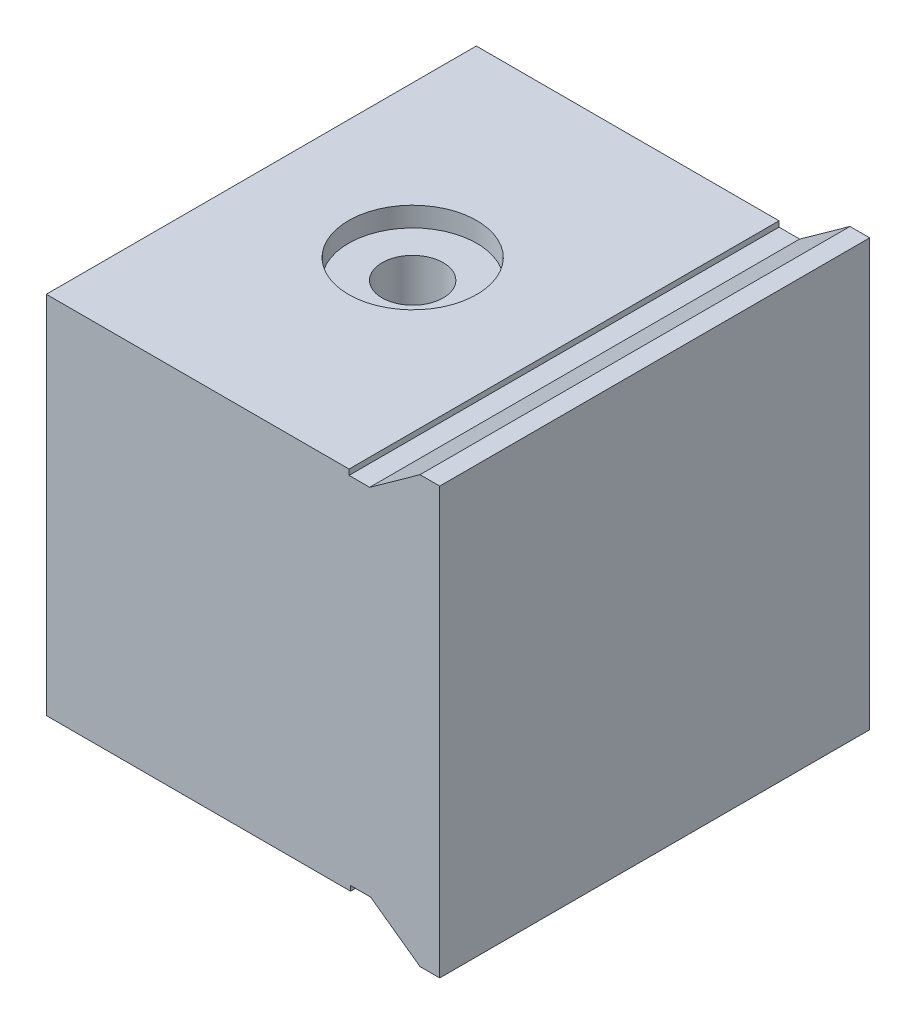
ISO-10303-21;
HEADER;
FILE_DESCRIPTION(('STEP AP214'),'2;1');
FILE_NAME('part.step','',(''),(''),'','','');
FILE_SCHEMA(('AUTOMOTIVE_DESIGN { 1 0 10303 214 1 1 1 1 }'));
ENDSEC;
DATA;
#1=APPLICATION_CONTEXT('core data for automotive mechanical design processes');
#2=APPLICATION_PROTOCOL_DEFINITION('international standard','automotive_design',2000,#1);
#3=PRODUCT_CONTEXT('',#1,'mechanical');
#4=PRODUCT('Part','Part','',(#3));
#5=PRODUCT_RELATED_PRODUCT_CATEGORY('part','',(#4));
#6=PRODUCT_DEFINITION_FORMATION('','',#4);
#7=PRODUCT_DEFINITION_CONTEXT('part definition',#1,'design');
#8=PRODUCT_DEFINITION('design','',#6,#7);
#9=PRODUCT_DEFINITION_SHAPE('','',#8);
#10=(LENGTH_UNIT() NAMED_UNIT(*) SI_UNIT(.MILLI.,.METRE.));
#11=(NAMED_UNIT(*) PLANE_ANGLE_UNIT() SI_UNIT($,.RADIAN.));
#12=(NAMED_UNIT(*) SI_UNIT($,.STERADIAN.) SOLID_ANGLE_UNIT());
#13=UNCERTAINTY_MEASURE_WITH_UNIT(LENGTH_MEASURE(1.E-05),#10,'distance_accuracy_value','');
#14=(GEOMETRIC_REPRESENTATION_CONTEXT(3) GLOBAL_UNCERTAINTY_ASSIGNED_CONTEXT((#13)) GLOBAL_UNIT_ASSIGNED_CONTEXT((#10,
#11,#12)) REPRESENTATION_CONTEXT('',''));
#15=CARTESIAN_POINT('',(0.,0.,0.));
#16=DIRECTION('',(0.,0.,1.));
#17=DIRECTION('',(1.,0.,0.));
#18=AXIS2_PLACEMENT_3D('',#15,#16,#17);
#19=CARTESIAN_POINT('',(-1.16941230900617E-13,-16.7583056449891,-21.8));
#20=DIRECTION('',(0.,1.,0.));
#21=DIRECTION('',(-1.,0.,0.));
#22=AXIS2_PLACEMENT_3D('',#19,#20,#21);
#23=PLANE('',#22);
#24=DIRECTION('',(0.,0.,1.));
#25=VECTOR('',#24,1.);
#26=CARTESIAN_POINT('',(-0.135433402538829,-16.758305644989,-21.8));
#27=LINE('',#26,#25);
#28=CARTESIAN_POINT('',(-0.135433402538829,-16.758305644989,-21.8));
#29=VERTEX_POINT('',#28);
#30=CARTESIAN_POINT('',(-0.135433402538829,-16.758305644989,21.8));
#31=VERTEX_POINT('',#30);
#32=EDGE_CURVE('E303',#29,#31,#27,.T.);
#33=ORIENTED_EDGE('',*,*,#32,.T.);
#34=DIRECTION('',(-1.,0.,0.));
#35=VECTOR('',#34,1.);
#36=CARTESIAN_POINT('',(-1.16941230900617E-13,-16.7583056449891,21.8));
#37=LINE('',#36,#35);
#38=CARTESIAN_POINT('',(-30.989332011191,-16.7583056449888,21.8));
#39=VERTEX_POINT('',#38);
#40=EDGE_CURVE('E223',#31,#39,#37,.T.);
#41=ORIENTED_EDGE('',*,*,#40,.T.);
#42=DIRECTION('',(0.,0.,1.));
#43=VECTOR('',#42,1.);
#44=CARTESIAN_POINT('',(-30.989332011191,-16.7583056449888,-21.8));
#45=LINE('',#44,#43);
#46=CARTESIAN_POINT('',(-30.989332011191,-16.7583056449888,-21.8));
#47=VERTEX_POINT('',#46);
#48=EDGE_CURVE('E11',#47,#39,#45,.T.);
#49=ORIENTED_EDGE('',*,*,#48,.F.);
#50=DIRECTION('',(-1.,0.,0.));
#51=VECTOR('',#50,1.);
#52=CARTESIAN_POINT('',(-1.16941230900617E-13,-16.7583056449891,-21.8));
#53=LINE('',#52,#51);
#54=EDGE_CURVE('E72',#29,#47,#53,.T.);
#55=ORIENTED_EDGE('',*,*,#54,.F.);
#56=EDGE_LOOP('',(#33,#41,#49,#55));
#57=FACE_BOUND('',#56,.T.);
#58=ADVANCED_FACE('F47',(#57),#23,.F.);
#59=CARTESIAN_POINT('',(-30.989332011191,0.,-21.8));
#60=DIRECTION('',(-1.,0.,0.));
#61=DIRECTION('',(0.,0.,1.));
#62=AXIS2_PLACEMENT_3D('',#59,#60,#61);
#63=PLANE('',#62);
#64=DIRECTION('',(0.,1.,0.));
#65=VECTOR('',#64,1.);
#66=CARTESIAN_POINT('',(-30.989332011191,-8.75830564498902,10.5));
#67=LINE('',#66,#65);
#68=CARTESIAN_POINT('',(-30.989332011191,-8.75830564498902,10.5));
#69=VERTEX_POINT('',#68);
#70=CARTESIAN_POINT('',(-30.989332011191,12.241694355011,10.5));
#71=VERTEX_POINT('',#70);
#72=EDGE_CURVE('E64',#69,#71,#67,.T.);
#73=ORIENTED_EDGE('',*,*,#72,.F.);
#74=DIRECTION('',(0.,0.,1.));
#75=VECTOR('',#74,1.);
#76=CARTESIAN_POINT('',(-30.989332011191,-8.75830564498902,-10.5));
#77=LINE('',#76,#75);
#78=CARTESIAN_POINT('',(-30.989332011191,-8.75830564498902,-10.5));
#79=VERTEX_POINT('',#78);
#80=EDGE_CURVE('E187',#79,#69,#77,.T.);
#81=ORIENTED_EDGE('',*,*,#80,.F.);
#82=DIRECTION('',(0.,-1.,0.));
#83=VECTOR('',#82,1.);
#84=CARTESIAN_POINT('',(-30.989332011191,-8.75830564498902,-10.5));
#85=LINE('',#84,#83);
#86=CARTESIAN_POINT('',(-30.989332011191,12.241694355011,-10.5));
#87=VERTEX_POINT('',#86);
#88=EDGE_CURVE('E191',#87,#79,#85,.T.);
#89=ORIENTED_EDGE('',*,*,#88,.F.);
#90=DIRECTION('',(0.,0.,-1.));
#91=VECTOR('',#90,1.);
#92=CARTESIAN_POINT('',(-30.989332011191,12.241694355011,-10.5));
#93=LINE('',#92,#91);
#94=EDGE_CURVE('E200',#71,#87,#93,.T.);
#95=ORIENTED_EDGE('',*,*,#94,.F.);
#96=EDGE_LOOP('',(#73,#81,#89,#95));
#97=FACE_BOUND('',#96,.T.);
#98=ORIENTED_EDGE('',*,*,#48,.T.);
#99=DIRECTION('',(0.,-1.,0.));
#100=VECTOR('',#99,1.);
#101=CARTESIAN_POINT('',(-30.989332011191,0.,21.8));
#102=LINE('',#101,#100);
#103=CARTESIAN_POINT('',(-30.989332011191,20.241694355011,21.8));
#104=VERTEX_POINT('',#103);
#105=EDGE_CURVE('E264',#104,#39,#102,.T.);
#106=ORIENTED_EDGE('',*,*,#105,.F.);
#107=DIRECTION('',(0.,0.,1.));
#108=VECTOR('',#107,1.);
#109=CARTESIAN_POINT('',(-30.989332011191,20.241694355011,-21.8));
#110=LINE('',#109,#108);
#111=CARTESIAN_POINT('',(-30.989332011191,20.241694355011,-21.8));
#112=VERTEX_POINT('',#111);
#113=EDGE_CURVE('E56',#112,#104,#110,.T.);
#114=ORIENTED_EDGE('',*,*,#113,.F.);
#115=DIRECTION('',(0.,-1.,0.));
#116=VECTOR('',#115,1.);
#117=CARTESIAN_POINT('',(-30.989332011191,0.,-21.8));
#118=LINE('',#117,#116);
#119=EDGE_CURVE('E300',#112,#47,#118,.T.);
#120=ORIENTED_EDGE('',*,*,#119,.T.);
#121=EDGE_LOOP('',(#98,#106,#114,#120));
#122=FACE_BOUND('',#121,.T.);
#123=ADVANCED_FACE('F356',(#97,#122),#63,.T.);
#124=CARTESIAN_POINT('',(0.,20.241694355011,-21.8));
#125=DIRECTION('',(0.,1.,0.));
#126=DIRECTION('',(0.,0.,1.));
#127=AXIS2_PLACEMENT_3D('',#124,#125,#126);
#128=PLANE('',#127);
#129=CARTESIAN_POINT('',(-15.6401057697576,20.241694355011,0.));
#130=DIRECTION('',(0.,1.,0.));
#131=DIRECTION('',(0.,0.,1.));
#132=AXIS2_PLACEMENT_3D('',#129,#130,#131);
#133=CIRCLE('',#132,6.5);
#134=CARTESIAN_POINT('',(-15.6401057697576,20.241694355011,6.5));
#135=VERTEX_POINT('',#134);
#136=EDGE_CURVE('E219',#135,#135,#133,.T.);
#137=ORIENTED_EDGE('',*,*,#136,.F.);
#138=EDGE_LOOP('',(#137));
#139=FACE_BOUND('',#138,.T.);
#140=ORIENTED_EDGE('',*,*,#113,.T.);
#141=DIRECTION('',(-1.,0.,0.));
#142=VECTOR('',#141,1.);
#143=CARTESIAN_POINT('',(0.,20.241694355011,21.8));
#144=LINE('',#143,#142);
#145=CARTESIAN_POINT('',(-0.290879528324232,20.241694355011,21.8));
#146=VERTEX_POINT('',#145);
#147=EDGE_CURVE('E260',#146,#104,#144,.T.);
#148=ORIENTED_EDGE('',*,*,#147,.F.);
#149=DIRECTION('',(0.,0.,1.));
#150=VECTOR('',#149,1.);
#151=CARTESIAN_POINT('',(-0.290879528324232,20.241694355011,-21.8));
#152=LINE('',#151,#150);
#153=CARTESIAN_POINT('',(-0.290879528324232,20.241694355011,-21.8));
#154=VERTEX_POINT('',#153);
#155=EDGE_CURVE('E307',#154,#146,#152,.T.);
#156=ORIENTED_EDGE('',*,*,#155,.F.);
#157=DIRECTION('',(-1.,0.,0.));
#158=VECTOR('',#157,1.);
#159=CARTESIAN_POINT('',(0.,20.241694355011,-21.8));
#160=LINE('',#159,#158);
#161=EDGE_CURVE('E296',#154,#112,#160,.T.);
#162=ORIENTED_EDGE('',*,*,#161,.T.);
#163=EDGE_LOOP('',(#140,#148,#156,#162));
#164=FACE_BOUND('',#163,.T.);
#165=ADVANCED_FACE('F361',(#139,#164),#128,.T.);
#166=CARTESIAN_POINT('',(-0.205835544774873,-0.000864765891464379,-21.8));
#167=DIRECTION('',(0.999991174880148,0.00420120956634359,0.));
#168=DIRECTION('',(-0.00420120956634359,0.999991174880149,0.));
#169=AXIS2_PLACEMENT_3D('',#166,#167,#168);
#170=PLANE('',#169);
#171=ORIENTED_EDGE('',*,*,#155,.T.);
#172=DIRECTION('',(-0.00420120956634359,0.999991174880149,0.));
#173=VECTOR('',#172,1.);
#174=CARTESIAN_POINT('',(-0.205835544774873,-0.000864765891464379,21.8));
#175=LINE('',#174,#173);
#176=CARTESIAN_POINT('',(-0.288534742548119,19.6835776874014,21.8));
#177=VERTEX_POINT('',#176);
#178=EDGE_CURVE('E232',#177,#146,#175,.T.);
#179=ORIENTED_EDGE('',*,*,#178,.F.);
#180=DIRECTION('',(0.,0.,1.));
#181=VECTOR('',#180,1.);
#182=CARTESIAN_POINT('',(-0.288534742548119,19.6835776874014,-21.8));
#183=LINE('',#182,#181);
#184=CARTESIAN_POINT('',(-0.288534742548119,19.6835776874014,-21.8));
#185=VERTEX_POINT('',#184);
#186=EDGE_CURVE('E310',#185,#177,#183,.T.);
#187=ORIENTED_EDGE('',*,*,#186,.F.);
#188=DIRECTION('',(-0.00420120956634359,0.999991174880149,0.));
#189=VECTOR('',#188,1.);
#190=CARTESIAN_POINT('',(-0.205835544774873,-0.000864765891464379,-21.8));
#191=LINE('',#190,#189);
#192=EDGE_CURVE('E275',#185,#154,#191,.T.);
#193=ORIENTED_EDGE('',*,*,#192,.T.);
#194=EDGE_LOOP('',(#171,#179,#187,#193));
#195=FACE_BOUND('',#194,.T.);
#196=ADVANCED_FACE('F382',(#195),#170,.T.);
#197=CARTESIAN_POINT('',(0.,19.6835776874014,-21.8));
#198=DIRECTION('',(0.,-1.,0.));
#199=DIRECTION('',(1.,0.,0.));
#200=AXIS2_PLACEMENT_3D('',#197,#198,#199);
#201=PLANE('',#200);
#202=ORIENTED_EDGE('',*,*,#186,.T.);
#203=DIRECTION('',(1.,0.,0.));
#204=VECTOR('',#203,1.);
#205=CARTESIAN_POINT('',(0.,19.6835776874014,21.8));
#206=LINE('',#205,#204);
#207=CARTESIAN_POINT('',(1.80132440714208,19.6835776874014,21.8));
#208=VERTEX_POINT('',#207);
#209=EDGE_CURVE('E256',#177,#208,#206,.T.);
#210=ORIENTED_EDGE('',*,*,#209,.T.);
#211=DIRECTION('',(0.,0.,1.));
#212=VECTOR('',#211,1.);
#213=CARTESIAN_POINT('',(1.80132440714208,19.6835776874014,-21.8));
#214=LINE('',#213,#212);
#215=CARTESIAN_POINT('',(1.80132440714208,19.6835776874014,-21.8));
#216=VERTEX_POINT('',#215);
#217=EDGE_CURVE('E313',#216,#208,#214,.T.);
#218=ORIENTED_EDGE('',*,*,#217,.F.);
#219=DIRECTION('',(1.,0.,0.));
#220=VECTOR('',#219,1.);
#221=CARTESIAN_POINT('',(0.,19.6835776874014,-21.8));
#222=LINE('',#221,#220);
#223=EDGE_CURVE('E293',#185,#216,#222,.T.);
#224=ORIENTED_EDGE('',*,*,#223,.F.);
#225=EDGE_LOOP('',(#202,#210,#218,#224));
#226=FACE_BOUND('',#225,.T.);
#227=ADVANCED_FACE('F395',(#226),#201,.F.);
#228=CARTESIAN_POINT('',(-8.7097527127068,12.1465502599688,-21.8));
#229=DIRECTION('',(0.582727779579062,-0.812667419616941,0.));
#230=DIRECTION('',(0.812667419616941,0.582727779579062,0.));
#231=AXIS2_PLACEMENT_3D('',#228,#229,#230);
#232=PLANE('',#231);
#233=ORIENTED_EDGE('',*,*,#217,.T.);
#234=DIRECTION('',(0.812667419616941,0.582727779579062,0.));
#235=VECTOR('',#234,1.);
#236=CARTESIAN_POINT('',(-8.7097527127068,12.1465502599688,21.8));
#237=LINE('',#236,#235);
#238=CARTESIAN_POINT('',(6.9029046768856,23.3416947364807,21.8));
#239=VERTEX_POINT('',#238);
#240=EDGE_CURVE('E252',#208,#239,#237,.T.);
#241=ORIENTED_EDGE('',*,*,#240,.T.);
#242=DIRECTION('',(0.,0.,1.));
#243=VECTOR('',#242,1.);
#244=CARTESIAN_POINT('',(6.9029046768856,23.3416947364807,-21.8));
#245=LINE('',#244,#243);
#246=CARTESIAN_POINT('',(6.9029046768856,23.3416947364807,-21.8));
#247=VERTEX_POINT('',#246);
#248=EDGE_CURVE('E316',#247,#239,#245,.T.);
#249=ORIENTED_EDGE('',*,*,#248,.F.);
#250=DIRECTION('',(0.812667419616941,0.582727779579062,0.));
#251=VECTOR('',#250,1.);
#252=CARTESIAN_POINT('',(-8.7097527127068,12.1465502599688,-21.8));
#253=LINE('',#252,#251);
#254=EDGE_CURVE('E290',#216,#247,#253,.T.);
#255=ORIENTED_EDGE('',*,*,#254,.F.);
#256=EDGE_LOOP('',(#233,#241,#249,#255));
#257=FACE_BOUND('',#256,.T.);
#258=ADVANCED_FACE('F402',(#257),#232,.F.);
#259=CARTESIAN_POINT('',(0.,23.3416947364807,-21.8));
#260=DIRECTION('',(0.,-1.,0.));
#261=DIRECTION('',(0.,0.,-1.));
#262=AXIS2_PLACEMENT_3D('',#259,#260,#261);
#263=PLANE('',#262);
#264=ORIENTED_EDGE('',*,*,#248,.T.);
#265=DIRECTION('',(1.,0.,0.));
#266=VECTOR('',#265,1.);
#267=CARTESIAN_POINT('',(0.,23.3416947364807,21.8));
#268=LINE('',#267,#266);
#269=CARTESIAN_POINT('',(8.90290515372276,23.3416947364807,21.8));
#270=VERTEX_POINT('',#269);
#271=EDGE_CURVE('E248',#239,#270,#268,.T.);
#272=ORIENTED_EDGE('',*,*,#271,.T.);
#273=DIRECTION('',(0.,0.,1.));
#274=VECTOR('',#273,1.);
#275=CARTESIAN_POINT('',(8.90290515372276,23.3416947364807,-21.8));
#276=LINE('',#275,#274);
#277=CARTESIAN_POINT('',(8.90290515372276,23.3416947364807,-21.8));
#278=VERTEX_POINT('',#277);
#279=EDGE_CURVE('E319',#278,#270,#276,.T.);
#280=ORIENTED_EDGE('',*,*,#279,.F.);
#281=DIRECTION('',(1.,0.,0.));
#282=VECTOR('',#281,1.);
#283=CARTESIAN_POINT('',(0.,23.3416947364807,-21.8));
#284=LINE('',#283,#282);
#285=EDGE_CURVE('E287',#247,#278,#284,.T.);
#286=ORIENTED_EDGE('',*,*,#285,.F.);
#287=EDGE_LOOP('',(#264,#272,#280,#286));
#288=FACE_BOUND('',#287,.T.);
#289=ADVANCED_FACE('F406',(#288),#263,.F.);
#290=CARTESIAN_POINT('',(8.90290515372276,0.,-21.8));
#291=DIRECTION('',(-1.,0.,0.));
#292=DIRECTION('',(0.,0.,1.));
#293=AXIS2_PLACEMENT_3D('',#290,#291,#292);
#294=PLANE('',#293);
#295=ORIENTED_EDGE('',*,*,#279,.T.);
#296=DIRECTION('',(0.,-1.,0.));
#297=VECTOR('',#296,1.);
#298=CARTESIAN_POINT('',(8.90290515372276,0.,21.8));
#299=LINE('',#298,#297);
#300=CARTESIAN_POINT('',(8.90290515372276,-19.8583060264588,21.8));
#301=VERTEX_POINT('',#300);
#302=EDGE_CURVE('E244',#270,#301,#299,.T.);
#303=ORIENTED_EDGE('',*,*,#302,.T.);
#304=DIRECTION('',(0.,0.,1.));
#305=VECTOR('',#304,1.);
#306=CARTESIAN_POINT('',(8.90290515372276,-19.8583060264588,-21.8));
#307=LINE('',#306,#305);
#308=CARTESIAN_POINT('',(8.90290515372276,-19.8583060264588,-21.8));
#309=VERTEX_POINT('',#308);
#310=EDGE_CURVE('E322',#309,#301,#307,.T.);
#311=ORIENTED_EDGE('',*,*,#310,.F.);
#312=DIRECTION('',(0.,-1.,0.));
#313=VECTOR('',#312,1.);
#314=CARTESIAN_POINT('',(8.90290515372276,0.,-21.8));
#315=LINE('',#314,#313);
#316=EDGE_CURVE('E284',#278,#309,#315,.T.);
#317=ORIENTED_EDGE('',*,*,#316,.F.);
#318=EDGE_LOOP('',(#295,#303,#311,#317));
#319=FACE_BOUND('',#318,.T.);
#320=ADVANCED_FACE('F410',(#319),#294,.F.);
#321=CARTESIAN_POINT('',(0.,-19.8583060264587,-21.8));
#322=DIRECTION('',(0.,1.,0.));
#323=DIRECTION('',(-1.,0.,0.));
#324=AXIS2_PLACEMENT_3D('',#321,#322,#323);
#325=PLANE('',#324);
#326=ORIENTED_EDGE('',*,*,#310,.T.);
#327=DIRECTION('',(-1.,0.,0.));
#328=VECTOR('',#327,1.);
#329=CARTESIAN_POINT('',(0.,-19.8583060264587,21.8));
#330=LINE('',#329,#328);
#331=CARTESIAN_POINT('',(6.9029046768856,-19.8583060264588,21.8));
#332=VERTEX_POINT('',#331);
#333=EDGE_CURVE('E240',#301,#332,#330,.T.);
#334=ORIENTED_EDGE('',*,*,#333,.T.);
#335=DIRECTION('',(0.,0.,1.));
#336=VECTOR('',#335,1.);
#337=CARTESIAN_POINT('',(6.9029046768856,-19.8583060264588,-21.8));
#338=LINE('',#337,#336);
#339=CARTESIAN_POINT('',(6.9029046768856,-19.8583060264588,-21.8));
#340=VERTEX_POINT('',#339);
#341=EDGE_CURVE('E325',#340,#332,#338,.T.);
#342=ORIENTED_EDGE('',*,*,#341,.F.);
#343=DIRECTION('',(-1.,0.,0.));
#344=VECTOR('',#343,1.);
#345=CARTESIAN_POINT('',(0.,-19.8583060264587,-21.8));
#346=LINE('',#345,#344);
#347=EDGE_CURVE('E281',#309,#340,#346,.T.);
#348=ORIENTED_EDGE('',*,*,#347,.F.);
#349=EDGE_LOOP('',(#326,#334,#342,#348));
#350=FACE_BOUND('',#349,.T.);
#351=ADVANCED_FACE('F414',(#350),#325,.F.);
#352=CARTESIAN_POINT('',(-7.05974351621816,-9.80519935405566,-21.8));
#353=DIRECTION('',(0.584304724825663,0.811534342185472,0.));
#354=DIRECTION('',(-0.811534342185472,0.584304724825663,0.));
#355=AXIS2_PLACEMENT_3D('',#352,#353,#354);
#356=PLANE('',#355);
#357=ORIENTED_EDGE('',*,*,#341,.T.);
#358=DIRECTION('',(-0.811534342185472,0.584304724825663,0.));
#359=VECTOR('',#358,1.);
#360=CARTESIAN_POINT('',(-7.05974351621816,-9.80519935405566,21.8));
#361=LINE('',#360,#359);
#362=CARTESIAN_POINT('',(1.90290479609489,-16.2583061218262,21.8));
#363=VERTEX_POINT('',#362);
#364=EDGE_CURVE('E236',#332,#363,#361,.T.);
#365=ORIENTED_EDGE('',*,*,#364,.T.);
#366=DIRECTION('',(0.,0.,1.));
#367=VECTOR('',#366,1.);
#368=CARTESIAN_POINT('',(1.90290479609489,-16.2583061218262,-21.8));
#369=LINE('',#368,#367);
#370=CARTESIAN_POINT('',(1.90290479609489,-16.2583061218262,-21.8));
#371=VERTEX_POINT('',#370);
#372=EDGE_CURVE('E328',#371,#363,#369,.T.);
#373=ORIENTED_EDGE('',*,*,#372,.F.);
#374=DIRECTION('',(-0.811534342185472,0.584304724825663,0.));
#375=VECTOR('',#374,1.);
#376=CARTESIAN_POINT('',(-7.05974351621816,-9.80519935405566,-21.8));
#377=LINE('',#376,#375);
#378=EDGE_CURVE('E278',#340,#371,#377,.T.);
#379=ORIENTED_EDGE('',*,*,#378,.F.);
#380=EDGE_LOOP('',(#357,#365,#373,#379));
#381=FACE_BOUND('',#380,.T.);
#382=ADVANCED_FACE('F418',(#381),#356,.F.);
#383=CARTESIAN_POINT('',(0.,-16.2583061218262,-21.8));
#384=DIRECTION('',(0.,1.,0.));
#385=DIRECTION('',(0.,0.,1.));
#386=AXIS2_PLACEMENT_3D('',#383,#384,#385);
#387=PLANE('',#386);
#388=ORIENTED_EDGE('',*,*,#372,.T.);
#389=DIRECTION('',(-1.,0.,0.));
#390=VECTOR('',#389,1.);
#391=CARTESIAN_POINT('',(0.,-16.2583061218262,21.8));
#392=LINE('',#391,#390);
#393=CARTESIAN_POINT('',(-0.137534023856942,-16.2583061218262,21.8));
#394=VERTEX_POINT('',#393);
#395=EDGE_CURVE('E231',#363,#394,#392,.T.);
#396=ORIENTED_EDGE('',*,*,#395,.T.);
#397=DIRECTION('',(0.,0.,1.));
#398=VECTOR('',#397,1.);
#399=CARTESIAN_POINT('',(-0.137534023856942,-16.2583061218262,-21.8));
#400=LINE('',#399,#398);
#401=CARTESIAN_POINT('',(-0.137534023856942,-16.2583061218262,-21.8));
#402=VERTEX_POINT('',#401);
#403=EDGE_CURVE('E331',#402,#394,#400,.T.);
#404=ORIENTED_EDGE('',*,*,#403,.F.);
#405=DIRECTION('',(-1.,0.,0.));
#406=VECTOR('',#405,1.);
#407=CARTESIAN_POINT('',(0.,-16.2583061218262,-21.8));
#408=LINE('',#407,#406);
#409=EDGE_CURVE('E274',#371,#402,#408,.T.);
#410=ORIENTED_EDGE('',*,*,#409,.F.);
#411=EDGE_LOOP('',(#388,#396,#404,#410));
#412=FACE_BOUND('',#411,.T.);
#413=ADVANCED_FACE('F421',(#412),#387,.F.);
#414=ORIENTED_EDGE('',*,*,#403,.T.);
#415=EDGE_CURVE('E227',#31,#394,#175,.T.);
#416=ORIENTED_EDGE('',*,*,#415,.F.);
#417=ORIENTED_EDGE('',*,*,#32,.F.);
#418=EDGE_CURVE('E270',#29,#402,#191,.T.);
#419=ORIENTED_EDGE('',*,*,#418,.T.);
#420=EDGE_LOOP('',(#414,#416,#417,#419));
#421=FACE_BOUND('',#420,.T.);
#422=ADVANCED_FACE('F367',(#421),#170,.T.);
#423=CARTESIAN_POINT('',(0.,0.,-21.8));
#424=DIRECTION('',(0.,0.,1.));
#425=DIRECTION('',(1.,0.,0.));
#426=AXIS2_PLACEMENT_3D('',#423,#424,#425);
#427=PLANE('',#426);
#428=ORIENTED_EDGE('',*,*,#54,.T.);
#429=ORIENTED_EDGE('',*,*,#119,.F.);
#430=ORIENTED_EDGE('',*,*,#161,.F.);
#431=ORIENTED_EDGE('',*,*,#192,.F.);
#432=ORIENTED_EDGE('',*,*,#223,.T.);
#433=ORIENTED_EDGE('',*,*,#254,.T.);
#434=ORIENTED_EDGE('',*,*,#285,.T.);
#435=ORIENTED_EDGE('',*,*,#316,.T.);
#436=ORIENTED_EDGE('',*,*,#347,.T.);
#437=ORIENTED_EDGE('',*,*,#378,.T.);
#438=ORIENTED_EDGE('',*,*,#409,.T.);
#439=ORIENTED_EDGE('',*,*,#418,.F.);
#440=EDGE_LOOP('',(#428,#429,#430,#431,#432,#433,#434,#435,#436,#437,#438,#439));
#441=FACE_BOUND('',#440,.T.);
#442=ADVANCED_FACE('F377',(#441),#427,.F.);
#443=CARTESIAN_POINT('',(0.,0.,21.8));
#444=DIRECTION('',(0.,0.,1.));
#445=DIRECTION('',(1.,0.,0.));
#446=AXIS2_PLACEMENT_3D('',#443,#444,#445);
#447=PLANE('',#446);
#448=ORIENTED_EDGE('',*,*,#40,.F.);
#449=ORIENTED_EDGE('',*,*,#415,.T.);
#450=ORIENTED_EDGE('',*,*,#395,.F.);
#451=ORIENTED_EDGE('',*,*,#364,.F.);
#452=ORIENTED_EDGE('',*,*,#333,.F.);
#453=ORIENTED_EDGE('',*,*,#302,.F.);
#454=ORIENTED_EDGE('',*,*,#271,.F.);
#455=ORIENTED_EDGE('',*,*,#240,.F.);
#456=ORIENTED_EDGE('',*,*,#209,.F.);
#457=ORIENTED_EDGE('',*,*,#178,.T.);
#458=ORIENTED_EDGE('',*,*,#147,.T.);
#459=ORIENTED_EDGE('',*,*,#105,.T.);
#460=EDGE_LOOP('',(#448,#449,#450,#451,#452,#453,#454,#455,#456,#457,#458,#459));
#461=FACE_BOUND('',#460,.T.);
#462=ADVANCED_FACE('F371',(#461),#447,.T.);
#463=CARTESIAN_POINT('',(-15.6401057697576,18.241694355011,0.));
#464=DIRECTION('',(0.,1.,0.));
#465=DIRECTION('',(0.,0.,1.));
#466=AXIS2_PLACEMENT_3D('',#463,#464,#465);
#467=PLANE('',#466);
#468=CARTESIAN_POINT('',(-15.6401057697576,18.241694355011,0.));
#469=DIRECTION('',(0.,1.,0.));
#470=DIRECTION('',(0.,0.,1.));
#471=AXIS2_PLACEMENT_3D('',#468,#469,#470);
#472=CIRCLE('',#471,6.5);
#473=CARTESIAN_POINT('',(-15.6401057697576,18.241694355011,6.5));
#474=VERTEX_POINT('',#473);
#475=EDGE_CURVE('E214',#474,#474,#472,.T.);
#476=ORIENTED_EDGE('',*,*,#475,.T.);
#477=EDGE_LOOP('',(#476));
#478=FACE_BOUND('',#477,.T.);
#479=CARTESIAN_POINT('',(-15.6401057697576,18.241694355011,0.));
#480=DIRECTION('',(0.,1.,0.));
#481=DIRECTION('',(0.,0.,1.));
#482=AXIS2_PLACEMENT_3D('',#479,#480,#481);
#483=CIRCLE('',#482,3.1);
#484=CARTESIAN_POINT('',(-15.6401057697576,18.241694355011,3.1));
#485=VERTEX_POINT('',#484);
#486=EDGE_CURVE('E218',#485,#485,#483,.F.);
#487=ORIENTED_EDGE('',*,*,#486,.T.);
#488=EDGE_LOOP('',(#487));
#489=FACE_BOUND('',#488,.T.);
#490=ADVANCED_FACE('F339',(#478,#489),#467,.T.);
#491=CARTESIAN_POINT('',(-15.6401057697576,18.241694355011,0.));
#492=DIRECTION('',(0.,1.,0.));
#493=DIRECTION('',(0.,0.,1.));
#494=AXIS2_PLACEMENT_3D('',#491,#492,#493);
#495=CYLINDRICAL_SURFACE('',#494,6.5);
#496=ORIENTED_EDGE('',*,*,#475,.F.);
#497=EDGE_LOOP('',(#496));
#498=FACE_BOUND('',#497,.T.);
#499=ORIENTED_EDGE('',*,*,#136,.T.);
#500=EDGE_LOOP('',(#499));
#501=FACE_BOUND('',#500,.T.);
#502=ADVANCED_FACE('F343',(#498,#501),#495,.F.);
#503=CARTESIAN_POINT('',(-15.6401057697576,10.241694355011,0.));
#504=DIRECTION('',(0.,1.,0.));
#505=DIRECTION('',(0.,0.,1.));
#506=AXIS2_PLACEMENT_3D('',#503,#504,#505);
#507=CYLINDRICAL_SURFACE('',#506,3.1);
#508=CARTESIAN_POINT('',(-15.6401057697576,12.241694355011,0.));
#509=DIRECTION('',(0.,1.,0.));
#510=DIRECTION('',(0.,0.,1.));
#511=AXIS2_PLACEMENT_3D('',#508,#509,#510);
#512=CIRCLE('',#511,3.1);
#513=CARTESIAN_POINT('',(-15.6401057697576,12.241694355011,3.1));
#514=VERTEX_POINT('',#513);
#515=EDGE_CURVE('E50',#514,#514,#512,.F.);
#516=ORIENTED_EDGE('',*,*,#515,.T.);
#517=EDGE_LOOP('',(#516));
#518=FACE_BOUND('',#517,.T.);
#519=ORIENTED_EDGE('',*,*,#486,.F.);
#520=EDGE_LOOP('',(#519));
#521=FACE_BOUND('',#520,.T.);
#522=ADVANCED_FACE('F341',(#518,#521),#507,.F.);
#523=CARTESIAN_POINT('',(-2.98933201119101,12.241694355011,-10.5));
#524=DIRECTION('',(0.,1.,0.));
#525=DIRECTION('',(0.,0.,1.));
#526=AXIS2_PLACEMENT_3D('',#523,#524,#525);
#527=PLANE('',#526);
#528=ORIENTED_EDGE('',*,*,#94,.T.);
#529=DIRECTION('',(-1.,0.,0.));
#530=VECTOR('',#529,1.);
#531=CARTESIAN_POINT('',(-2.98933201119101,12.241694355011,-10.5));
#532=LINE('',#531,#530);
#533=CARTESIAN_POINT('',(-2.98933201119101,12.241694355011,-10.5));
#534=VERTEX_POINT('',#533);
#535=EDGE_CURVE('E171',#534,#87,#532,.T.);
#536=ORIENTED_EDGE('',*,*,#535,.F.);
#537=DIRECTION('',(0.,0.,-1.));
#538=VECTOR('',#537,1.);
#539=CARTESIAN_POINT('',(-2.98933201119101,12.241694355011,-10.5));
#540=LINE('',#539,#538);
#541=CARTESIAN_POINT('',(-2.98933201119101,12.241694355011,10.5));
#542=VERTEX_POINT('',#541);
#543=EDGE_CURVE('E175',#542,#534,#540,.T.);
#544=ORIENTED_EDGE('',*,*,#543,.F.);
#545=DIRECTION('',(-1.,0.,0.));
#546=VECTOR('',#545,1.);
#547=CARTESIAN_POINT('',(-2.98933201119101,12.241694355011,10.5));
#548=LINE('',#547,#546);
#549=EDGE_CURVE('E161',#542,#71,#548,.T.);
#550=ORIENTED_EDGE('',*,*,#549,.T.);
#551=EDGE_LOOP('',(#528,#536,#544,#550));
#552=FACE_BOUND('',#551,.T.);
#553=ORIENTED_EDGE('',*,*,#515,.F.);
#554=EDGE_LOOP('',(#553));
#555=FACE_BOUND('',#554,.T.);
#556=ADVANCED_FACE('F176',(#552,#555),#527,.F.);
#557=CARTESIAN_POINT('',(-2.98933201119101,-8.75830564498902,10.5));
#558=DIRECTION('',(0.,0.,1.));
#559=DIRECTION('',(1.,0.,0.));
#560=AXIS2_PLACEMENT_3D('',#557,#558,#559);
#561=PLANE('',#560);
#562=ORIENTED_EDGE('',*,*,#72,.T.);
#563=ORIENTED_EDGE('',*,*,#549,.F.);
#564=DIRECTION('',(0.,1.,0.));
#565=VECTOR('',#564,1.);
#566=CARTESIAN_POINT('',(-2.98933201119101,-8.75830564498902,10.5));
#567=LINE('',#566,#565);
#568=CARTESIAN_POINT('',(-2.98933201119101,-8.75830564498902,10.5));
#569=VERTEX_POINT('',#568);
#570=EDGE_CURVE('E165',#569,#542,#567,.T.);
#571=ORIENTED_EDGE('',*,*,#570,.F.);
#572=DIRECTION('',(-1.,0.,0.));
#573=VECTOR('',#572,1.);
#574=CARTESIAN_POINT('',(-2.98933201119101,-8.75830564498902,10.5));
#575=LINE('',#574,#573);
#576=EDGE_CURVE('E206',#569,#69,#575,.T.);
#577=ORIENTED_EDGE('',*,*,#576,.T.);
#578=EDGE_LOOP('',(#562,#563,#571,#577));
#579=FACE_BOUND('',#578,.T.);
#580=ADVANCED_FACE('F163',(#579),#561,.F.);
#581=CARTESIAN_POINT('',(-2.98933201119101,-8.75830564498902,-10.5));
#582=DIRECTION('',(0.,-1.,0.));
#583=DIRECTION('',(0.,0.,-1.));
#584=AXIS2_PLACEMENT_3D('',#581,#582,#583);
#585=PLANE('',#584);
#586=ORIENTED_EDGE('',*,*,#80,.T.);
#587=ORIENTED_EDGE('',*,*,#576,.F.);
#588=DIRECTION('',(0.,0.,1.));
#589=VECTOR('',#588,1.);
#590=CARTESIAN_POINT('',(-2.98933201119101,-8.75830564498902,-10.5));
#591=LINE('',#590,#589);
#592=CARTESIAN_POINT('',(-2.98933201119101,-8.75830564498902,-10.5));
#593=VERTEX_POINT('',#592);
#594=EDGE_CURVE('E172',#593,#569,#591,.T.);
#595=ORIENTED_EDGE('',*,*,#594,.F.);
#596=DIRECTION('',(-1.,0.,0.));
#597=VECTOR('',#596,1.);
#598=CARTESIAN_POINT('',(-2.98933201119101,-8.75830564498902,-10.5));
#599=LINE('',#598,#597);
#600=EDGE_CURVE('E209',#593,#79,#599,.T.);
#601=ORIENTED_EDGE('',*,*,#600,.T.);
#602=EDGE_LOOP('',(#586,#587,#595,#601));
#603=FACE_BOUND('',#602,.T.);
#604=ADVANCED_FACE('F459',(#603),#585,.F.);
#605=CARTESIAN_POINT('',(-2.98933201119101,-8.75830564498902,-10.5));
#606=DIRECTION('',(0.,0.,-1.));
#607=DIRECTION('',(-1.,0.,0.));
#608=AXIS2_PLACEMENT_3D('',#605,#606,#607);
#609=PLANE('',#608);
#610=ORIENTED_EDGE('',*,*,#88,.T.);
#611=ORIENTED_EDGE('',*,*,#600,.F.);
#612=DIRECTION('',(0.,-1.,0.));
#613=VECTOR('',#612,1.);
#614=CARTESIAN_POINT('',(-2.98933201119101,-8.75830564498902,-10.5));
#615=LINE('',#614,#613);
#616=EDGE_CURVE('E182',#534,#593,#615,.T.);
#617=ORIENTED_EDGE('',*,*,#616,.F.);
#618=ORIENTED_EDGE('',*,*,#535,.T.);
#619=EDGE_LOOP('',(#610,#611,#617,#618));
#620=FACE_BOUND('',#619,.T.);
#621=ADVANCED_FACE('F461',(#620),#609,.F.);
#622=CARTESIAN_POINT('',(-2.98933201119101,0.,0.));
#623=DIRECTION('',(1.,0.,0.));
#624=DIRECTION('',(0.,0.,-1.));
#625=AXIS2_PLACEMENT_3D('',#622,#623,#624);
#626=PLANE('',#625);
#627=ORIENTED_EDGE('',*,*,#570,.T.);
#628=ORIENTED_EDGE('',*,*,#543,.T.);
#629=ORIENTED_EDGE('',*,*,#616,.T.);
#630=ORIENTED_EDGE('',*,*,#594,.T.);
#631=EDGE_LOOP('',(#627,#628,#629,#630));
#632=FACE_BOUND('',#631,.T.);
#633=ADVANCED_FACE('F184',(#632),#626,.F.);
#634=CLOSED_SHELL('',(#58,#123,#165,#196,#227,#258,#289,#320,#351,#382,#413,#422,#442,#462,#490,
#502,#522,#556,#580,#604,#621,#633));
#635=MANIFOLD_SOLID_BREP('B2',#634);
#636=ADVANCED_BREP_SHAPE_REPRESENTATION('',(#18,#635),#14);
#637=SHAPE_DEFINITION_REPRESENTATION(#9,#636);
ENDSEC;
END-ISO-10303-21;
